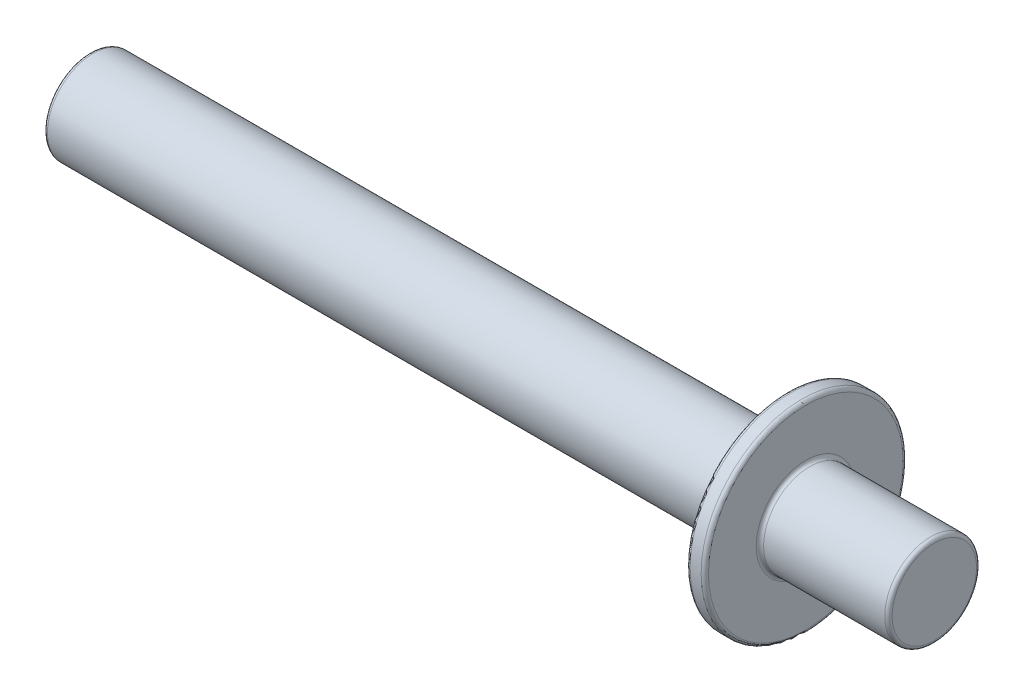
from build123d import *

# Parameters (mm, degrees)
CONG_1_R = 0.2


with BuildPart() as part:
    # Esquisse1 → R_volution1 (revolve)
    with BuildSketch(Plane.XY, mode=Mode.PRIVATE) as r_volution1_sk:
        Polygon((-46, 0), (-46, 2.5), (-8, 2.5), (-8, 5.5), (-7, 5.5), (-7, 2.5), (0, 2.5), (0, 0), align=None)
    revolve(r_volution1_sk.sketch.rotate(Axis((-86.086708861, 0, 0), (1, 0, 0)), 90), axis=Axis((-86.086708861, 0, 0), (1, 0, 0)))

    # Cong_1
    cong_1_edges = [part.edges().sort_by_distance(p)[0] for p in [
        (-46, 0, -2.5),
        (-8, 0, -2.5),
        (-8, 0, -5.5),
        (-7, 0, -5.5),
        (-7, 0, -2.5),
        (0, 0, -2.5),
    ]]
    fillet(cong_1_edges, radius=CONG_1_R)


solid = part.part
